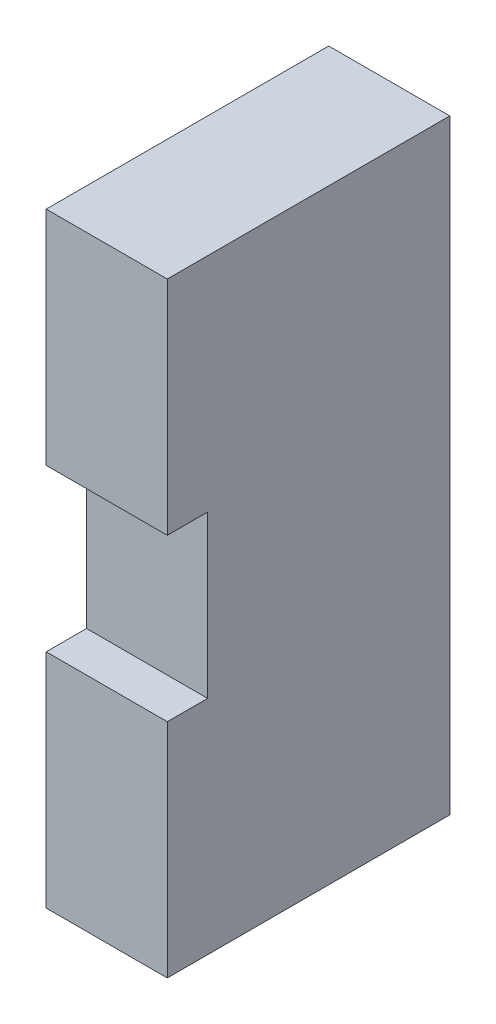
ISO-10303-21;
HEADER;
FILE_DESCRIPTION(('STEP AP214'),'2;1');
FILE_NAME('part.step','',(''),(''),'','','');
FILE_SCHEMA(('AUTOMOTIVE_DESIGN { 1 0 10303 214 1 1 1 1 }'));
ENDSEC;
DATA;
#1=APPLICATION_CONTEXT('core data for automotive mechanical design processes');
#2=APPLICATION_PROTOCOL_DEFINITION('international standard','automotive_design',2000,#1);
#3=PRODUCT_CONTEXT('',#1,'mechanical');
#4=PRODUCT('Part','Part','',(#3));
#5=PRODUCT_RELATED_PRODUCT_CATEGORY('part','',(#4));
#6=PRODUCT_DEFINITION_FORMATION('','',#4);
#7=PRODUCT_DEFINITION_CONTEXT('part definition',#1,'design');
#8=PRODUCT_DEFINITION('design','',#6,#7);
#9=PRODUCT_DEFINITION_SHAPE('','',#8);
#10=(LENGTH_UNIT() NAMED_UNIT(*) SI_UNIT(.MILLI.,.METRE.));
#11=(NAMED_UNIT(*) PLANE_ANGLE_UNIT() SI_UNIT($,.RADIAN.));
#12=(NAMED_UNIT(*) SI_UNIT($,.STERADIAN.) SOLID_ANGLE_UNIT());
#13=UNCERTAINTY_MEASURE_WITH_UNIT(LENGTH_MEASURE(1.E-05),#10,'distance_accuracy_value','');
#14=(GEOMETRIC_REPRESENTATION_CONTEXT(3) GLOBAL_UNCERTAINTY_ASSIGNED_CONTEXT((#13)) GLOBAL_UNIT_ASSIGNED_CONTEXT((#10,
#11,#12)) REPRESENTATION_CONTEXT('',''));
#15=CARTESIAN_POINT('',(0.,0.,0.));
#16=DIRECTION('',(0.,0.,1.));
#17=DIRECTION('',(1.,0.,0.));
#18=AXIS2_PLACEMENT_3D('',#15,#16,#17);
#19=CARTESIAN_POINT('',(0.,15.,7.));
#20=DIRECTION('',(1.,0.,0.));
#21=DIRECTION('',(0.,0.,-1.));
#22=AXIS2_PLACEMENT_3D('',#19,#20,#21);
#23=PLANE('',#22);
#24=DIRECTION('',(0.,1.,0.));
#25=VECTOR('',#24,1.);
#26=CARTESIAN_POINT('',(0.,30.,14.));
#27=LINE('',#26,#25);
#28=CARTESIAN_POINT('',(0.,30.,14.));
#29=VERTEX_POINT('',#28);
#30=CARTESIAN_POINT('',(0.,19.,14.));
#31=VERTEX_POINT('',#30);
#32=EDGE_CURVE('E119',#29,#31,#27,.F.);
#33=ORIENTED_EDGE('',*,*,#32,.F.);
#34=DIRECTION('',(0.,0.,1.));
#35=VECTOR('',#34,1.);
#36=CARTESIAN_POINT('',(0.,30.,0.));
#37=LINE('',#36,#35);
#38=CARTESIAN_POINT('',(0.,30.,0.));
#39=VERTEX_POINT('',#38);
#40=EDGE_CURVE('E111',#39,#29,#37,.T.);
#41=ORIENTED_EDGE('',*,*,#40,.F.);
#42=DIRECTION('',(0.,1.,0.));
#43=VECTOR('',#42,1.);
#44=CARTESIAN_POINT('',(0.,0.,0.));
#45=LINE('',#44,#43);
#46=CARTESIAN_POINT('',(0.,0.,0.));
#47=VERTEX_POINT('',#46);
#48=EDGE_CURVE('E105',#47,#39,#45,.T.);
#49=ORIENTED_EDGE('',*,*,#48,.F.);
#50=DIRECTION('',(0.,0.,-1.));
#51=VECTOR('',#50,1.);
#52=CARTESIAN_POINT('',(0.,0.,14.));
#53=LINE('',#52,#51);
#54=CARTESIAN_POINT('',(0.,0.,14.));
#55=VERTEX_POINT('',#54);
#56=EDGE_CURVE('E80',#55,#47,#53,.T.);
#57=ORIENTED_EDGE('',*,*,#56,.F.);
#58=DIRECTION('',(0.,1.,0.));
#59=VECTOR('',#58,1.);
#60=CARTESIAN_POINT('',(0.,30.,14.));
#61=LINE('',#60,#59);
#62=CARTESIAN_POINT('',(0.,11.,14.));
#63=VERTEX_POINT('',#62);
#64=EDGE_CURVE('E92',#63,#55,#61,.F.);
#65=ORIENTED_EDGE('',*,*,#64,.F.);
#66=DIRECTION('',(0.,0.,-1.));
#67=VECTOR('',#66,1.);
#68=CARTESIAN_POINT('',(0.,11.,14.));
#69=LINE('',#68,#67);
#70=CARTESIAN_POINT('',(0.,11.,12.));
#71=VERTEX_POINT('',#70);
#72=EDGE_CURVE('E20',#63,#71,#69,.T.);
#73=ORIENTED_EDGE('',*,*,#72,.T.);
#74=DIRECTION('',(0.,1.,0.));
#75=VECTOR('',#74,1.);
#76=CARTESIAN_POINT('',(0.,15.,12.));
#77=LINE('',#76,#75);
#78=CARTESIAN_POINT('',(0.,19.,12.));
#79=VERTEX_POINT('',#78);
#80=EDGE_CURVE('E126',#71,#79,#77,.T.);
#81=ORIENTED_EDGE('',*,*,#80,.T.);
#82=DIRECTION('',(0.,0.,1.));
#83=VECTOR('',#82,1.);
#84=CARTESIAN_POINT('',(0.,19.,14.));
#85=LINE('',#84,#83);
#86=EDGE_CURVE('E122',#79,#31,#85,.T.);
#87=ORIENTED_EDGE('',*,*,#86,.T.);
#88=EDGE_LOOP('',(#33,#41,#49,#57,#65,#73,#81,#87));
#89=FACE_BOUND('',#88,.T.);
#90=ADVANCED_FACE('F17',(#89),#23,.F.);
#91=CARTESIAN_POINT('',(6.,11.,14.));
#92=DIRECTION('',(0.,-1.,0.));
#93=DIRECTION('',(0.,0.,-1.));
#94=AXIS2_PLACEMENT_3D('',#91,#92,#93);
#95=PLANE('',#94);
#96=DIRECTION('',(0.,0.,-1.));
#97=VECTOR('',#96,1.);
#98=CARTESIAN_POINT('',(6.,11.,7.));
#99=LINE('',#98,#97);
#100=CARTESIAN_POINT('',(6.,11.,12.));
#101=VERTEX_POINT('',#100);
#102=CARTESIAN_POINT('',(6.,11.,14.));
#103=VERTEX_POINT('',#102);
#104=EDGE_CURVE('E130',#101,#103,#99,.F.);
#105=ORIENTED_EDGE('',*,*,#104,.F.);
#106=DIRECTION('',(-1.,0.,0.));
#107=VECTOR('',#106,1.);
#108=CARTESIAN_POINT('',(3.,11.,12.));
#109=LINE('',#108,#107);
#110=EDGE_CURVE('E90',#101,#71,#109,.T.);
#111=ORIENTED_EDGE('',*,*,#110,.T.);
#112=ORIENTED_EDGE('',*,*,#72,.F.);
#113=DIRECTION('',(1.,0.,0.));
#114=VECTOR('',#113,1.);
#115=CARTESIAN_POINT('',(0.,11.,14.));
#116=LINE('',#115,#114);
#117=EDGE_CURVE('E87',#103,#63,#116,.F.);
#118=ORIENTED_EDGE('',*,*,#117,.F.);
#119=EDGE_LOOP('',(#105,#111,#112,#118));
#120=FACE_BOUND('',#119,.T.);
#121=ADVANCED_FACE('F85',(#120),#95,.F.);
#122=CARTESIAN_POINT('',(0.,30.,14.));
#123=DIRECTION('',(0.,0.,1.));
#124=DIRECTION('',(1.,0.,0.));
#125=AXIS2_PLACEMENT_3D('',#122,#123,#124);
#126=PLANE('',#125);
#127=DIRECTION('',(1.,0.,0.));
#128=VECTOR('',#127,1.);
#129=CARTESIAN_POINT('',(0.,0.,14.));
#130=LINE('',#129,#128);
#131=CARTESIAN_POINT('',(6.,0.,14.));
#132=VERTEX_POINT('',#131);
#133=EDGE_CURVE('E103',#132,#55,#130,.F.);
#134=ORIENTED_EDGE('',*,*,#133,.F.);
#135=DIRECTION('',(0.,1.,0.));
#136=VECTOR('',#135,1.);
#137=CARTESIAN_POINT('',(6.,15.,14.));
#138=LINE('',#137,#136);
#139=EDGE_CURVE('E99',#103,#132,#138,.F.);
#140=ORIENTED_EDGE('',*,*,#139,.F.);
#141=ORIENTED_EDGE('',*,*,#117,.T.);
#142=ORIENTED_EDGE('',*,*,#64,.T.);
#143=EDGE_LOOP('',(#134,#140,#141,#142));
#144=FACE_BOUND('',#143,.T.);
#145=ADVANCED_FACE('F97',(#144),#126,.T.);
#146=CARTESIAN_POINT('',(0.,0.,14.));
#147=DIRECTION('',(0.,-1.,0.));
#148=DIRECTION('',(0.,0.,-1.));
#149=AXIS2_PLACEMENT_3D('',#146,#147,#148);
#150=PLANE('',#149);
#151=DIRECTION('',(0.,0.,-1.));
#152=VECTOR('',#151,1.);
#153=CARTESIAN_POINT('',(6.,0.,7.));
#154=LINE('',#153,#152);
#155=CARTESIAN_POINT('',(6.,0.,0.));
#156=VERTEX_POINT('',#155);
#157=EDGE_CURVE('E133',#132,#156,#154,.T.);
#158=ORIENTED_EDGE('',*,*,#157,.F.);
#159=ORIENTED_EDGE('',*,*,#133,.T.);
#160=ORIENTED_EDGE('',*,*,#56,.T.);
#161=DIRECTION('',(-1.,0.,0.));
#162=VECTOR('',#161,1.);
#163=CARTESIAN_POINT('',(0.,0.,0.));
#164=LINE('',#163,#162);
#165=EDGE_CURVE('E108',#156,#47,#164,.T.);
#166=ORIENTED_EDGE('',*,*,#165,.F.);
#167=EDGE_LOOP('',(#158,#159,#160,#166));
#168=FACE_BOUND('',#167,.T.);
#169=ADVANCED_FACE('F174',(#168),#150,.T.);
#170=CARTESIAN_POINT('',(0.,0.,0.));
#171=DIRECTION('',(0.,0.,-1.));
#172=DIRECTION('',(-1.,0.,0.));
#173=AXIS2_PLACEMENT_3D('',#170,#171,#172);
#174=PLANE('',#173);
#175=DIRECTION('',(0.,1.,0.));
#176=VECTOR('',#175,1.);
#177=CARTESIAN_POINT('',(6.,15.,0.));
#178=LINE('',#177,#176);
#179=CARTESIAN_POINT('',(6.,30.,0.));
#180=VERTEX_POINT('',#179);
#181=EDGE_CURVE('E136',#156,#180,#178,.T.);
#182=ORIENTED_EDGE('',*,*,#181,.F.);
#183=ORIENTED_EDGE('',*,*,#165,.T.);
#184=ORIENTED_EDGE('',*,*,#48,.T.);
#185=DIRECTION('',(1.,0.,0.));
#186=VECTOR('',#185,1.);
#187=CARTESIAN_POINT('',(0.,30.,0.));
#188=LINE('',#187,#186);
#189=EDGE_CURVE('E113',#180,#39,#188,.F.);
#190=ORIENTED_EDGE('',*,*,#189,.F.);
#191=EDGE_LOOP('',(#182,#183,#184,#190));
#192=FACE_BOUND('',#191,.T.);
#193=ADVANCED_FACE('F170',(#192),#174,.T.);
#194=CARTESIAN_POINT('',(0.,30.,0.));
#195=DIRECTION('',(0.,1.,0.));
#196=DIRECTION('',(0.,0.,1.));
#197=AXIS2_PLACEMENT_3D('',#194,#195,#196);
#198=PLANE('',#197);
#199=DIRECTION('',(0.,0.,-1.));
#200=VECTOR('',#199,1.);
#201=CARTESIAN_POINT('',(6.,30.,7.));
#202=LINE('',#201,#200);
#203=CARTESIAN_POINT('',(6.,30.,14.));
#204=VERTEX_POINT('',#203);
#205=EDGE_CURVE('E139',#180,#204,#202,.F.);
#206=ORIENTED_EDGE('',*,*,#205,.F.);
#207=ORIENTED_EDGE('',*,*,#189,.T.);
#208=ORIENTED_EDGE('',*,*,#40,.T.);
#209=DIRECTION('',(1.,0.,0.));
#210=VECTOR('',#209,1.);
#211=CARTESIAN_POINT('',(0.,30.,14.));
#212=LINE('',#211,#210);
#213=EDGE_CURVE('E116',#204,#29,#212,.F.);
#214=ORIENTED_EDGE('',*,*,#213,.F.);
#215=EDGE_LOOP('',(#206,#207,#208,#214));
#216=FACE_BOUND('',#215,.T.);
#217=ADVANCED_FACE('F167',(#216),#198,.T.);
#218=CARTESIAN_POINT('',(0.,30.,14.));
#219=DIRECTION('',(0.,0.,1.));
#220=DIRECTION('',(1.,0.,0.));
#221=AXIS2_PLACEMENT_3D('',#218,#219,#220);
#222=PLANE('',#221);
#223=ORIENTED_EDGE('',*,*,#213,.T.);
#224=ORIENTED_EDGE('',*,*,#32,.T.);
#225=DIRECTION('',(1.,0.,0.));
#226=VECTOR('',#225,1.);
#227=CARTESIAN_POINT('',(0.,19.,14.));
#228=LINE('',#227,#226);
#229=CARTESIAN_POINT('',(6.,19.,14.));
#230=VERTEX_POINT('',#229);
#231=EDGE_CURVE('E124',#31,#230,#228,.T.);
#232=ORIENTED_EDGE('',*,*,#231,.T.);
#233=DIRECTION('',(0.,1.,0.));
#234=VECTOR('',#233,1.);
#235=CARTESIAN_POINT('',(6.,15.,14.));
#236=LINE('',#235,#234);
#237=EDGE_CURVE('E142',#204,#230,#236,.F.);
#238=ORIENTED_EDGE('',*,*,#237,.F.);
#239=EDGE_LOOP('',(#223,#224,#232,#238));
#240=FACE_BOUND('',#239,.T.);
#241=ADVANCED_FACE('F152',(#240),#222,.T.);
#242=CARTESIAN_POINT('',(0.,19.,14.));
#243=DIRECTION('',(0.,1.,0.));
#244=DIRECTION('',(0.,0.,1.));
#245=AXIS2_PLACEMENT_3D('',#242,#243,#244);
#246=PLANE('',#245);
#247=ORIENTED_EDGE('',*,*,#86,.F.);
#248=DIRECTION('',(-1.,0.,0.));
#249=VECTOR('',#248,1.);
#250=CARTESIAN_POINT('',(3.,19.,12.));
#251=LINE('',#250,#249);
#252=CARTESIAN_POINT('',(6.,19.,12.));
#253=VERTEX_POINT('',#252);
#254=EDGE_CURVE('E35',#79,#253,#251,.F.);
#255=ORIENTED_EDGE('',*,*,#254,.T.);
#256=DIRECTION('',(0.,0.,-1.));
#257=VECTOR('',#256,1.);
#258=CARTESIAN_POINT('',(6.,19.,7.));
#259=LINE('',#258,#257);
#260=EDGE_CURVE('E26',#230,#253,#259,.T.);
#261=ORIENTED_EDGE('',*,*,#260,.F.);
#262=ORIENTED_EDGE('',*,*,#231,.F.);
#263=EDGE_LOOP('',(#247,#255,#261,#262));
#264=FACE_BOUND('',#263,.T.);
#265=ADVANCED_FACE('F150',(#264),#246,.F.);
#266=CARTESIAN_POINT('',(3.,15.,12.));
#267=DIRECTION('',(0.,0.,-1.));
#268=DIRECTION('',(-1.,0.,0.));
#269=AXIS2_PLACEMENT_3D('',#266,#267,#268);
#270=PLANE('',#269);
#271=DIRECTION('',(0.,1.,0.));
#272=VECTOR('',#271,1.);
#273=CARTESIAN_POINT('',(6.,15.,12.));
#274=LINE('',#273,#272);
#275=EDGE_CURVE('E11',#253,#101,#274,.F.);
#276=ORIENTED_EDGE('',*,*,#275,.F.);
#277=ORIENTED_EDGE('',*,*,#254,.F.);
#278=ORIENTED_EDGE('',*,*,#80,.F.);
#279=ORIENTED_EDGE('',*,*,#110,.F.);
#280=EDGE_LOOP('',(#276,#277,#278,#279));
#281=FACE_BOUND('',#280,.T.);
#282=ADVANCED_FACE('F154',(#281),#270,.F.);
#283=CARTESIAN_POINT('',(6.,15.,7.));
#284=DIRECTION('',(1.,0.,0.));
#285=DIRECTION('',(0.,0.,-1.));
#286=AXIS2_PLACEMENT_3D('',#283,#284,#285);
#287=PLANE('',#286);
#288=ORIENTED_EDGE('',*,*,#260,.T.);
#289=ORIENTED_EDGE('',*,*,#275,.T.);
#290=ORIENTED_EDGE('',*,*,#104,.T.);
#291=ORIENTED_EDGE('',*,*,#139,.T.);
#292=ORIENTED_EDGE('',*,*,#157,.T.);
#293=ORIENTED_EDGE('',*,*,#181,.T.);
#294=ORIENTED_EDGE('',*,*,#205,.T.);
#295=ORIENTED_EDGE('',*,*,#237,.T.);
#296=EDGE_LOOP('',(#288,#289,#290,#291,#292,#293,#294,#295));
#297=FACE_BOUND('',#296,.T.);
#298=ADVANCED_FACE('F147',(#297),#287,.T.);
#299=CLOSED_SHELL('',(#90,#121,#145,#169,#193,#217,#241,#265,#282,#298));
#300=MANIFOLD_SOLID_BREP('B1',#299);
#301=ADVANCED_BREP_SHAPE_REPRESENTATION('',(#18,#300),#14);
#302=SHAPE_DEFINITION_REPRESENTATION(#9,#301);
ENDSEC;
END-ISO-10303-21;
